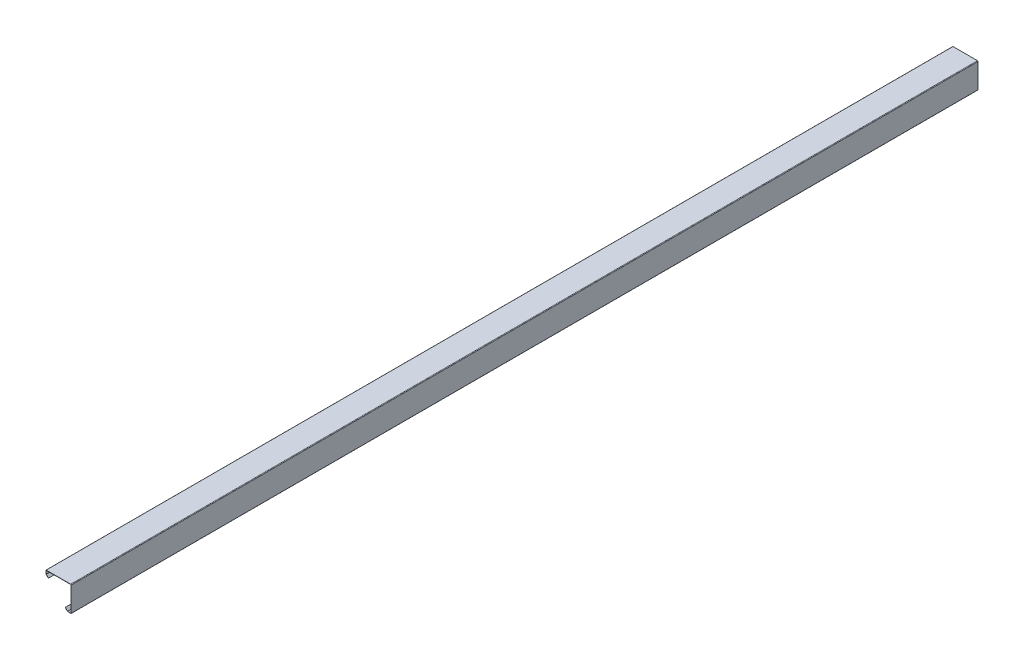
from build123d import *

# Parameters (mm, degrees)
EXTRUDE_THIN1_DEPTH = 2000


with BuildPart() as part:
    # Sketch1 → Extrude-Thin1 (new body)
    with BuildSketch(Plane.XY):
        with BuildLine():
            Line((-50.390389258, -13.2803299), (-55.441783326, -8.228935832))
            ThreePointArc((-55.441783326, -8.228935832), (-55.531126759, -8.095223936), (-55.5625, -7.9375))
            Line((-55.5625, -7.9375), (-55.5625, -0.412152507))
            ThreePointArc((-55.5625, -0.412152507), (-55.441783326, -0.120716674), (-55.150347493, 0))
            Line((-55.150347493, 0), (-1.27, 0))
            ThreePointArc((-1.27, 0), (-0.371974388, -0.371974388), (0, -1.27))
            Line((0, -1.27), (0, -55.150347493))
            ThreePointArc((0, -55.150347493), (-0.120716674, -55.441783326), (-0.412152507, -55.5625))
            Line((-0.412152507, -55.5625), (-7.9375, -55.5625))
            ThreePointArc((-7.9375, -55.5625), (-8.095223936, -55.531126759), (-8.228935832, -55.441783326))
            Line((-8.228935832, -55.441783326), (-13.2803299, -50.390389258))
            Line((-13.2803299, -50.390389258), (-12.921119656, -50.031179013))
            Line((-12.921119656, -50.031179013), (-7.897798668, -55.0545))
            Line((-7.897798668, -55.0545), (-0.508, -55.0545))
            Line((-0.508, -55.0545), (-0.508, -1.27))
            ThreePointArc((-0.508, -1.27), (-0.731184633, -0.731184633), (-1.27, -0.508))
            Line((-1.27, -0.508), (-55.0545, -0.508))
            Line((-55.0545, -0.508), (-55.0545, -7.897798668))
            Line((-55.0545, -7.897798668), (-50.031179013, -12.921119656))
            Line((-50.031179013, -12.921119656), (-50.390389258, -13.2803299))
        make_face()
    extrude(amount=EXTRUDE_THIN1_DEPTH)


solid = part.part
